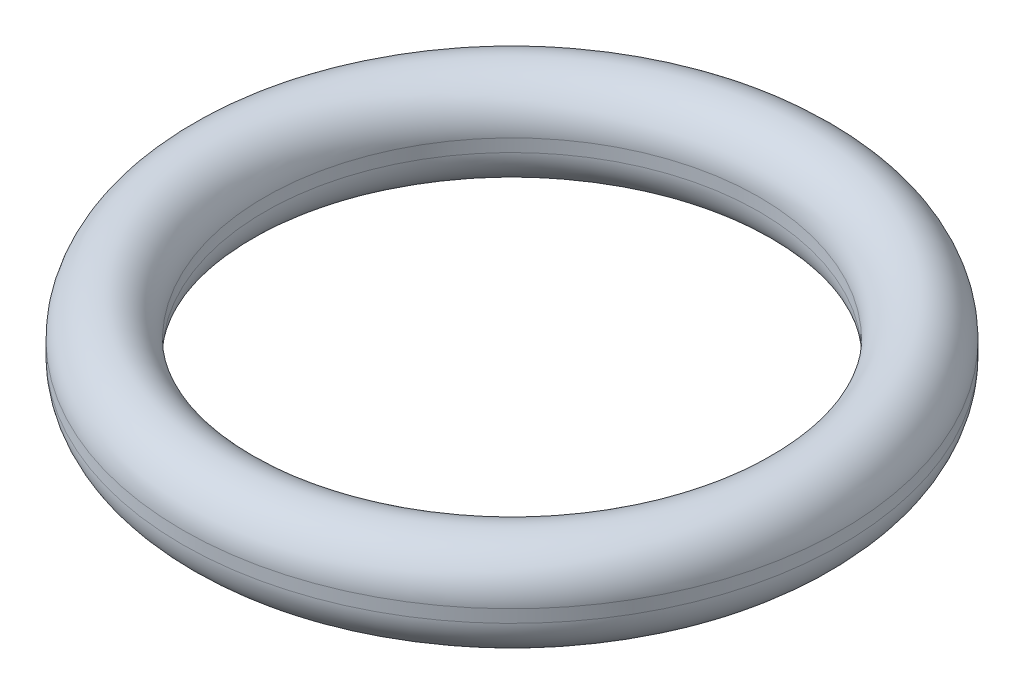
from build123d import *


with BuildPart() as part:
    # Sketch1 → Revolve1 (revolve)
    with BuildSketch(Plane.XY, mode=Mode.PRIVATE) as revolve1_sk:
        with BuildLine():
            Line((2.4765, 0), (2.4765, 0.127))
            ThreePointArc((2.4765, 0.127), (2.88925, 0.53975), (3.302, 0.127))
            Line((3.302, 0.127), (3.302, 0))
            ThreePointArc((3.302, 0), (2.88925, -0.41275), (2.4765, 0))
        make_face()
    revolve(revolve1_sk.sketch.rotate(Axis((0, 0, 0), (0, 1, 0)), 90), axis=Axis((0, 0, 0), (0, 1, 0)))


solid = part.part
